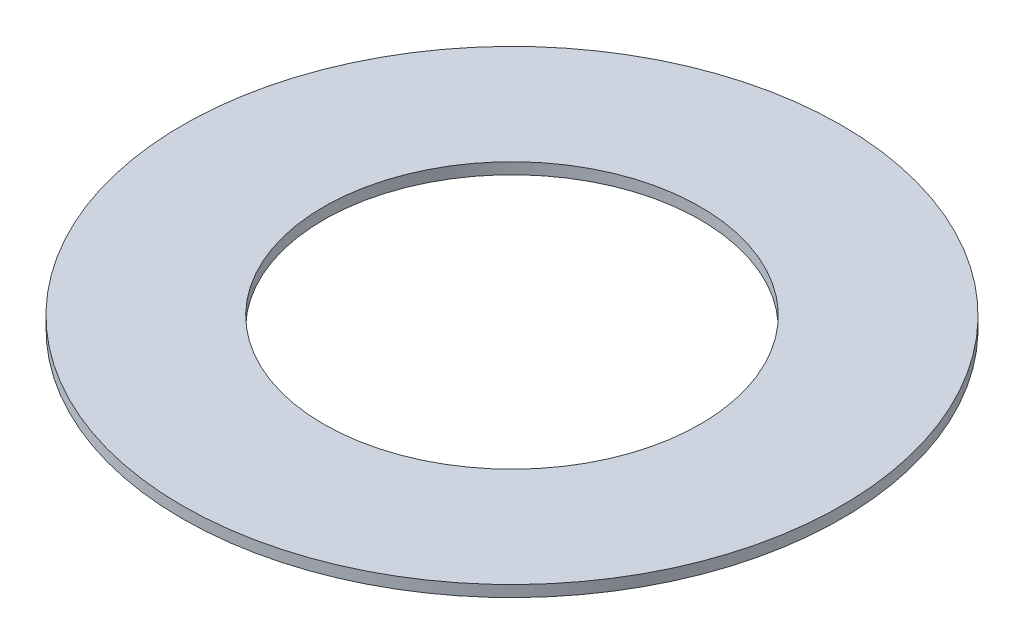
from build123d import *

# Parameters (mm, degrees)
BASE_PROFILE_R     = 350
BASE_PROFILE_R_2   = 200
BASE_EXTRUDE_DEPTH = 12


with BuildPart() as part:
    # Base_Profile → Base_Extrude (new body)
    with BuildSketch(Plane(origin=(0, 0, 0), x_dir=(1, 0, 0), z_dir=(0, 1, 0))):
        with Locations(Location((0, 0, 0), (0, 0, 270))):
            Circle(BASE_PROFILE_R)
        with Locations(Location((0, 0, 0), (0, 0, 270))):
            Circle(BASE_PROFILE_R_2, mode=Mode.SUBTRACT)
    extrude(amount=BASE_EXTRUDE_DEPTH)


solid = part.part
